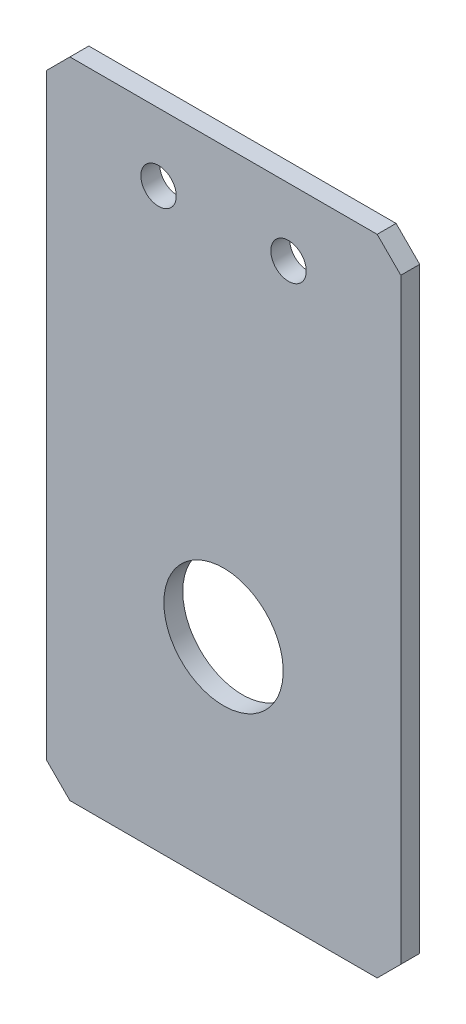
ISO-10303-21;
HEADER;
FILE_DESCRIPTION(('STEP AP214'),'2;1');
FILE_NAME('part.step','',(''),(''),'','','');
FILE_SCHEMA(('AUTOMOTIVE_DESIGN { 1 0 10303 214 1 1 1 1 }'));
ENDSEC;
DATA;
#1=APPLICATION_CONTEXT('core data for automotive mechanical design processes');
#2=APPLICATION_PROTOCOL_DEFINITION('international standard','automotive_design',2000,#1);
#3=PRODUCT_CONTEXT('',#1,'mechanical');
#4=PRODUCT('Part','Part','',(#3));
#5=PRODUCT_RELATED_PRODUCT_CATEGORY('part','',(#4));
#6=PRODUCT_DEFINITION_FORMATION('','',#4);
#7=PRODUCT_DEFINITION_CONTEXT('part definition',#1,'design');
#8=PRODUCT_DEFINITION('design','',#6,#7);
#9=PRODUCT_DEFINITION_SHAPE('','',#8);
#10=(LENGTH_UNIT() NAMED_UNIT(*) SI_UNIT(.MILLI.,.METRE.));
#11=(NAMED_UNIT(*) PLANE_ANGLE_UNIT() SI_UNIT($,.RADIAN.));
#12=(NAMED_UNIT(*) SI_UNIT($,.STERADIAN.) SOLID_ANGLE_UNIT());
#13=UNCERTAINTY_MEASURE_WITH_UNIT(LENGTH_MEASURE(1.E-05),#10,'distance_accuracy_value','');
#14=(GEOMETRIC_REPRESENTATION_CONTEXT(3) GLOBAL_UNCERTAINTY_ASSIGNED_CONTEXT((#13)) GLOBAL_UNIT_ASSIGNED_CONTEXT((#10,
#11,#12)) REPRESENTATION_CONTEXT('',''));
#15=CARTESIAN_POINT('',(0.,0.,0.));
#16=DIRECTION('',(0.,0.,1.));
#17=DIRECTION('',(1.,0.,0.));
#18=AXIS2_PLACEMENT_3D('',#15,#16,#17);
#19=CARTESIAN_POINT('',(15.,17.1267114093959,1.6));
#20=DIRECTION('',(0.,0.,-0.999999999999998));
#21=DIRECTION('',(-1.,0.,0.));
#22=AXIS2_PLACEMENT_3D('',#19,#20,#21);
#23=PLANE('',#22);
#24=CARTESIAN_POINT('',(5.50000000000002,65.926711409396,1.6));
#25=DIRECTION('',(0.,0.,0.999999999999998));
#26=DIRECTION('',(1.,0.,0.));
#27=AXIS2_PLACEMENT_3D('',#24,#25,#26);
#28=CIRCLE('',#27,1.5);
#29=CARTESIAN_POINT('',(4.00000000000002,65.926711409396,1.6));
#30=VERTEX_POINT('',#29);
#31=EDGE_CURVE('E219',#30,#30,#28,.T.);
#32=ORIENTED_EDGE('',*,*,#31,.F.);
#33=EDGE_LOOP('',(#32));
#34=FACE_BOUND('',#33,.T.);
#35=DIRECTION('',(0.,1.,0.));
#36=VECTOR('',#35,1.);
#37=CARTESIAN_POINT('',(15.,69.626711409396,1.6));
#38=LINE('',#37,#36);
#39=CARTESIAN_POINT('',(15.,19.1267114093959,1.6));
#40=VERTEX_POINT('',#39);
#41=CARTESIAN_POINT('',(15.,69.626711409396,1.6));
#42=VERTEX_POINT('',#41);
#43=EDGE_CURVE('E124',#40,#42,#38,.T.);
#44=ORIENTED_EDGE('',*,*,#43,.T.);
#45=DIRECTION('',(-0.707106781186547,0.707106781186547,0.));
#46=VECTOR('',#45,1.);
#47=CARTESIAN_POINT('',(13.,71.626711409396,1.6));
#48=LINE('',#47,#46);
#49=CARTESIAN_POINT('',(13.,71.626711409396,1.6));
#50=VERTEX_POINT('',#49);
#51=EDGE_CURVE('E101',#42,#50,#48,.T.);
#52=ORIENTED_EDGE('',*,*,#51,.T.);
#53=DIRECTION('',(-1.,0.,0.));
#54=VECTOR('',#53,1.);
#55=CARTESIAN_POINT('',(-13.,71.626711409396,1.6));
#56=LINE('',#55,#54);
#57=CARTESIAN_POINT('',(-13.,71.626711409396,1.6));
#58=VERTEX_POINT('',#57);
#59=EDGE_CURVE('E127',#50,#58,#56,.T.);
#60=ORIENTED_EDGE('',*,*,#59,.T.);
#61=DIRECTION('',(-0.707106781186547,-0.707106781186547,0.));
#62=VECTOR('',#61,1.);
#63=CARTESIAN_POINT('',(-13.,71.626711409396,1.6));
#64=LINE('',#63,#62);
#65=CARTESIAN_POINT('',(-15.,69.626711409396,1.6));
#66=VERTEX_POINT('',#65);
#67=EDGE_CURVE('E129',#58,#66,#64,.T.);
#68=ORIENTED_EDGE('',*,*,#67,.T.);
#69=DIRECTION('',(0.,-1.,0.));
#70=VECTOR('',#69,1.);
#71=CARTESIAN_POINT('',(-15.,69.626711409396,1.6));
#72=LINE('',#71,#70);
#73=CARTESIAN_POINT('',(-15.,19.1267114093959,1.6));
#74=VERTEX_POINT('',#73);
#75=EDGE_CURVE('E131',#66,#74,#72,.T.);
#76=ORIENTED_EDGE('',*,*,#75,.T.);
#77=DIRECTION('',(0.707106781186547,-0.707106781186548,0.));
#78=VECTOR('',#77,1.);
#79=CARTESIAN_POINT('',(-15.,19.1267114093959,1.6));
#80=LINE('',#79,#78);
#81=CARTESIAN_POINT('',(-13.,17.1267114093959,1.6));
#82=VERTEX_POINT('',#81);
#83=EDGE_CURVE('E133',#74,#82,#80,.T.);
#84=ORIENTED_EDGE('',*,*,#83,.T.);
#85=DIRECTION('',(1.,0.,0.));
#86=VECTOR('',#85,1.);
#87=CARTESIAN_POINT('',(13.,17.1267114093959,1.6));
#88=LINE('',#87,#86);
#89=CARTESIAN_POINT('',(13.,17.1267114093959,1.6));
#90=VERTEX_POINT('',#89);
#91=EDGE_CURVE('E42',#82,#90,#88,.T.);
#92=ORIENTED_EDGE('',*,*,#91,.T.);
#93=DIRECTION('',(0.707106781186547,0.707106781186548,0.));
#94=VECTOR('',#93,1.);
#95=CARTESIAN_POINT('',(15.,19.1267114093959,1.6));
#96=LINE('',#95,#94);
#97=EDGE_CURVE('E37',#90,#40,#96,.T.);
#98=ORIENTED_EDGE('',*,*,#97,.T.);
#99=EDGE_LOOP('',(#44,#52,#60,#68,#76,#84,#92,#98));
#100=FACE_BOUND('',#99,.T.);
#101=CARTESIAN_POINT('',(0.,35.626711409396,1.6));
#102=DIRECTION('',(0.,0.,0.999999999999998));
#103=DIRECTION('',(1.,0.,0.));
#104=AXIS2_PLACEMENT_3D('',#101,#102,#103);
#105=CIRCLE('',#104,5.05);
#106=CARTESIAN_POINT('',(-5.05,35.626711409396,1.6));
#107=VERTEX_POINT('',#106);
#108=EDGE_CURVE('E106',#107,#107,#105,.T.);
#109=ORIENTED_EDGE('',*,*,#108,.F.);
#110=EDGE_LOOP('',(#109));
#111=FACE_BOUND('',#110,.T.);
#112=CARTESIAN_POINT('',(-5.49999999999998,65.926711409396,1.59999999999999));
#113=DIRECTION('',(0.,0.,0.999999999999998));
#114=DIRECTION('',(-1.,0.,0.));
#115=AXIS2_PLACEMENT_3D('',#112,#113,#114);
#116=CIRCLE('',#115,1.5);
#117=CARTESIAN_POINT('',(-6.99999999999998,65.926711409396,1.59999999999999));
#118=VERTEX_POINT('',#117);
#119=EDGE_CURVE('E208',#118,#118,#116,.T.);
#120=ORIENTED_EDGE('',*,*,#119,.F.);
#121=EDGE_LOOP('',(#120));
#122=FACE_BOUND('',#121,.T.);
#123=ADVANCED_FACE('F22',(#34,#100,#111,#122),#23,.F.);
#124=CARTESIAN_POINT('',(15.,17.1267114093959,0.));
#125=DIRECTION('',(0.,0.,-0.999999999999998));
#126=DIRECTION('',(-1.,0.,0.));
#127=AXIS2_PLACEMENT_3D('',#124,#125,#126);
#128=PLANE('',#127);
#129=CARTESIAN_POINT('',(5.5,65.926711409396,0.));
#130=DIRECTION('',(0.,0.,0.999999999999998));
#131=DIRECTION('',(1.,0.,0.));
#132=AXIS2_PLACEMENT_3D('',#129,#130,#131);
#133=CIRCLE('',#132,1.5);
#134=CARTESIAN_POINT('',(4.00000000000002,65.926711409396,0.));
#135=VERTEX_POINT('',#134);
#136=EDGE_CURVE('E214',#135,#135,#133,.T.);
#137=ORIENTED_EDGE('',*,*,#136,.T.);
#138=EDGE_LOOP('',(#137));
#139=FACE_BOUND('',#138,.T.);
#140=DIRECTION('',(0.,1.,0.));
#141=VECTOR('',#140,1.);
#142=CARTESIAN_POINT('',(15.,69.626711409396,0.));
#143=LINE('',#142,#141);
#144=CARTESIAN_POINT('',(15.,19.1267114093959,0.));
#145=VERTEX_POINT('',#144);
#146=CARTESIAN_POINT('',(15.,69.626711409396,0.));
#147=VERTEX_POINT('',#146);
#148=EDGE_CURVE('E92',#145,#147,#143,.T.);
#149=ORIENTED_EDGE('',*,*,#148,.F.);
#150=DIRECTION('',(0.707106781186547,0.707106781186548,0.));
#151=VECTOR('',#150,1.);
#152=CARTESIAN_POINT('',(15.,19.1267114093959,0.));
#153=LINE('',#152,#151);
#154=CARTESIAN_POINT('',(13.,17.1267114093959,0.));
#155=VERTEX_POINT('',#154);
#156=EDGE_CURVE('E122',#155,#145,#153,.T.);
#157=ORIENTED_EDGE('',*,*,#156,.F.);
#158=DIRECTION('',(1.,0.,0.));
#159=VECTOR('',#158,1.);
#160=CARTESIAN_POINT('',(13.,17.1267114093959,0.));
#161=LINE('',#160,#159);
#162=CARTESIAN_POINT('',(-13.,17.1267114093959,0.));
#163=VERTEX_POINT('',#162);
#164=EDGE_CURVE('E120',#163,#155,#161,.T.);
#165=ORIENTED_EDGE('',*,*,#164,.F.);
#166=DIRECTION('',(0.707106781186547,-0.707106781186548,0.));
#167=VECTOR('',#166,1.);
#168=CARTESIAN_POINT('',(-15.,19.1267114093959,0.));
#169=LINE('',#168,#167);
#170=CARTESIAN_POINT('',(-15.,19.1267114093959,0.));
#171=VERTEX_POINT('',#170);
#172=EDGE_CURVE('E118',#171,#163,#169,.T.);
#173=ORIENTED_EDGE('',*,*,#172,.F.);
#174=DIRECTION('',(0.,-1.,0.));
#175=VECTOR('',#174,1.);
#176=CARTESIAN_POINT('',(-15.,69.626711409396,0.));
#177=LINE('',#176,#175);
#178=CARTESIAN_POINT('',(-15.,69.626711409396,0.));
#179=VERTEX_POINT('',#178);
#180=EDGE_CURVE('E116',#179,#171,#177,.T.);
#181=ORIENTED_EDGE('',*,*,#180,.F.);
#182=DIRECTION('',(-0.707106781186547,-0.707106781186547,0.));
#183=VECTOR('',#182,1.);
#184=CARTESIAN_POINT('',(-13.,71.626711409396,0.));
#185=LINE('',#184,#183);
#186=CARTESIAN_POINT('',(-13.,71.626711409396,0.));
#187=VERTEX_POINT('',#186);
#188=EDGE_CURVE('E114',#187,#179,#185,.T.);
#189=ORIENTED_EDGE('',*,*,#188,.F.);
#190=DIRECTION('',(-1.,0.,0.));
#191=VECTOR('',#190,1.);
#192=CARTESIAN_POINT('',(-13.,71.626711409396,0.));
#193=LINE('',#192,#191);
#194=CARTESIAN_POINT('',(13.,71.626711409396,0.));
#195=VERTEX_POINT('',#194);
#196=EDGE_CURVE('E94',#195,#187,#193,.T.);
#197=ORIENTED_EDGE('',*,*,#196,.F.);
#198=DIRECTION('',(-0.707106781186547,0.707106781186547,0.));
#199=VECTOR('',#198,1.);
#200=CARTESIAN_POINT('',(13.,71.626711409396,0.));
#201=LINE('',#200,#199);
#202=EDGE_CURVE('E87',#147,#195,#201,.T.);
#203=ORIENTED_EDGE('',*,*,#202,.F.);
#204=EDGE_LOOP('',(#149,#157,#165,#173,#181,#189,#197,#203));
#205=FACE_BOUND('',#204,.T.);
#206=CARTESIAN_POINT('',(0.,35.626711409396,0.));
#207=DIRECTION('',(0.,0.,0.999999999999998));
#208=DIRECTION('',(1.,0.,0.));
#209=AXIS2_PLACEMENT_3D('',#206,#207,#208);
#210=CIRCLE('',#209,5.05);
#211=CARTESIAN_POINT('',(-5.05,35.626711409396,0.));
#212=VERTEX_POINT('',#211);
#213=EDGE_CURVE('E109',#212,#212,#210,.T.);
#214=ORIENTED_EDGE('',*,*,#213,.T.);
#215=EDGE_LOOP('',(#214));
#216=FACE_BOUND('',#215,.T.);
#217=CARTESIAN_POINT('',(-5.50000000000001,65.926711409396,0.));
#218=DIRECTION('',(0.,0.,0.999999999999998));
#219=DIRECTION('',(-1.,0.,0.));
#220=AXIS2_PLACEMENT_3D('',#217,#218,#219);
#221=CIRCLE('',#220,1.5);
#222=CARTESIAN_POINT('',(-6.99999999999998,65.926711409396,0.));
#223=VERTEX_POINT('',#222);
#224=EDGE_CURVE('E211',#223,#223,#221,.T.);
#225=ORIENTED_EDGE('',*,*,#224,.T.);
#226=EDGE_LOOP('',(#225));
#227=FACE_BOUND('',#226,.T.);
#228=ADVANCED_FACE('F88',(#139,#205,#216,#227),#128,.T.);
#229=CARTESIAN_POINT('',(15.,69.626711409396,1.6));
#230=DIRECTION('',(-1.,0.,0.));
#231=DIRECTION('',(0.,-1.,0.));
#232=AXIS2_PLACEMENT_3D('',#229,#230,#231);
#233=PLANE('',#232);
#234=ORIENTED_EDGE('',*,*,#148,.T.);
#235=DIRECTION('',(0.,0.,-0.999999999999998));
#236=VECTOR('',#235,1.);
#237=CARTESIAN_POINT('',(15.,69.626711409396,1.6));
#238=LINE('',#237,#236);
#239=EDGE_CURVE('E11',#42,#147,#238,.T.);
#240=ORIENTED_EDGE('',*,*,#239,.F.);
#241=ORIENTED_EDGE('',*,*,#43,.F.);
#242=DIRECTION('',(0.,0.,-0.999999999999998));
#243=VECTOR('',#242,1.);
#244=CARTESIAN_POINT('',(15.,19.1267114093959,1.6));
#245=LINE('',#244,#243);
#246=EDGE_CURVE('E105',#40,#145,#245,.T.);
#247=ORIENTED_EDGE('',*,*,#246,.T.);
#248=EDGE_LOOP('',(#234,#240,#241,#247));
#249=FACE_BOUND('',#248,.T.);
#250=ADVANCED_FACE('F24',(#249),#233,.F.);
#251=CARTESIAN_POINT('',(13.,71.626711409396,1.6));
#252=DIRECTION('',(-0.707106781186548,-0.707106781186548,0.));
#253=DIRECTION('',(0.707106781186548,-0.707106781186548,0.));
#254=AXIS2_PLACEMENT_3D('',#251,#252,#253);
#255=PLANE('',#254);
#256=ORIENTED_EDGE('',*,*,#202,.T.);
#257=DIRECTION('',(0.,0.,-0.999999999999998));
#258=VECTOR('',#257,1.);
#259=CARTESIAN_POINT('',(13.,71.626711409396,1.6));
#260=LINE('',#259,#258);
#261=EDGE_CURVE('E30',#50,#195,#260,.T.);
#262=ORIENTED_EDGE('',*,*,#261,.F.);
#263=ORIENTED_EDGE('',*,*,#51,.F.);
#264=ORIENTED_EDGE('',*,*,#239,.T.);
#265=EDGE_LOOP('',(#256,#262,#263,#264));
#266=FACE_BOUND('',#265,.T.);
#267=ADVANCED_FACE('F100',(#266),#255,.F.);
#268=CARTESIAN_POINT('',(-13.,71.626711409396,1.6));
#269=DIRECTION('',(0.,-1.,0.));
#270=DIRECTION('',(0.,0.,-0.999999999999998));
#271=AXIS2_PLACEMENT_3D('',#268,#269,#270);
#272=PLANE('',#271);
#273=ORIENTED_EDGE('',*,*,#196,.T.);
#274=DIRECTION('',(0.,0.,-0.999999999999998));
#275=VECTOR('',#274,1.);
#276=CARTESIAN_POINT('',(-13.,71.626711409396,1.6));
#277=LINE('',#276,#275);
#278=EDGE_CURVE('E150',#58,#187,#277,.T.);
#279=ORIENTED_EDGE('',*,*,#278,.F.);
#280=ORIENTED_EDGE('',*,*,#59,.F.);
#281=ORIENTED_EDGE('',*,*,#261,.T.);
#282=EDGE_LOOP('',(#273,#279,#280,#281));
#283=FACE_BOUND('',#282,.T.);
#284=ADVANCED_FACE('F154',(#283),#272,.F.);
#285=CARTESIAN_POINT('',(-13.,71.626711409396,1.6));
#286=DIRECTION('',(0.707106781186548,-0.707106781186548,0.));
#287=DIRECTION('',(0.707106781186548,0.707106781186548,0.));
#288=AXIS2_PLACEMENT_3D('',#285,#286,#287);
#289=PLANE('',#288);
#290=ORIENTED_EDGE('',*,*,#188,.T.);
#291=DIRECTION('',(0.,0.,-0.999999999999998));
#292=VECTOR('',#291,1.);
#293=CARTESIAN_POINT('',(-15.,69.626711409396,1.6));
#294=LINE('',#293,#292);
#295=EDGE_CURVE('E147',#66,#179,#294,.T.);
#296=ORIENTED_EDGE('',*,*,#295,.F.);
#297=ORIENTED_EDGE('',*,*,#67,.F.);
#298=ORIENTED_EDGE('',*,*,#278,.T.);
#299=EDGE_LOOP('',(#290,#296,#297,#298));
#300=FACE_BOUND('',#299,.T.);
#301=ADVANCED_FACE('F162',(#300),#289,.F.);
#302=CARTESIAN_POINT('',(-15.,69.626711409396,1.6));
#303=DIRECTION('',(1.,0.,0.));
#304=DIRECTION('',(0.,1.,0.));
#305=AXIS2_PLACEMENT_3D('',#302,#303,#304);
#306=PLANE('',#305);
#307=ORIENTED_EDGE('',*,*,#180,.T.);
#308=DIRECTION('',(0.,0.,-0.999999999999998));
#309=VECTOR('',#308,1.);
#310=CARTESIAN_POINT('',(-15.,19.1267114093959,1.6));
#311=LINE('',#310,#309);
#312=EDGE_CURVE('E144',#74,#171,#311,.T.);
#313=ORIENTED_EDGE('',*,*,#312,.F.);
#314=ORIENTED_EDGE('',*,*,#75,.F.);
#315=ORIENTED_EDGE('',*,*,#295,.T.);
#316=EDGE_LOOP('',(#307,#313,#314,#315));
#317=FACE_BOUND('',#316,.T.);
#318=ADVANCED_FACE('F165',(#317),#306,.F.);
#319=CARTESIAN_POINT('',(-15.,19.1267114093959,1.6));
#320=DIRECTION('',(0.707106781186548,0.707106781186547,0.));
#321=DIRECTION('',(-0.707106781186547,0.707106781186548,0.));
#322=AXIS2_PLACEMENT_3D('',#319,#320,#321);
#323=PLANE('',#322);
#324=ORIENTED_EDGE('',*,*,#172,.T.);
#325=DIRECTION('',(0.,0.,-0.999999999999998));
#326=VECTOR('',#325,1.);
#327=CARTESIAN_POINT('',(-13.,17.1267114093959,1.6));
#328=LINE('',#327,#326);
#329=EDGE_CURVE('E141',#82,#163,#328,.T.);
#330=ORIENTED_EDGE('',*,*,#329,.F.);
#331=ORIENTED_EDGE('',*,*,#83,.F.);
#332=ORIENTED_EDGE('',*,*,#312,.T.);
#333=EDGE_LOOP('',(#324,#330,#331,#332));
#334=FACE_BOUND('',#333,.T.);
#335=ADVANCED_FACE('F170',(#334),#323,.F.);
#336=CARTESIAN_POINT('',(13.,17.1267114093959,1.6));
#337=DIRECTION('',(0.,1.,0.));
#338=DIRECTION('',(-1.,0.,0.));
#339=AXIS2_PLACEMENT_3D('',#336,#337,#338);
#340=PLANE('',#339);
#341=ORIENTED_EDGE('',*,*,#164,.T.);
#342=DIRECTION('',(0.,0.,-0.999999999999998));
#343=VECTOR('',#342,1.);
#344=CARTESIAN_POINT('',(13.,17.1267114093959,1.6));
#345=LINE('',#344,#343);
#346=EDGE_CURVE('E138',#90,#155,#345,.T.);
#347=ORIENTED_EDGE('',*,*,#346,.F.);
#348=ORIENTED_EDGE('',*,*,#91,.F.);
#349=ORIENTED_EDGE('',*,*,#329,.T.);
#350=EDGE_LOOP('',(#341,#347,#348,#349));
#351=FACE_BOUND('',#350,.T.);
#352=ADVANCED_FACE('F173',(#351),#340,.F.);
#353=CARTESIAN_POINT('',(15.,19.1267114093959,1.6));
#354=DIRECTION('',(-0.707106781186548,0.707106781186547,0.));
#355=DIRECTION('',(-0.707106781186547,-0.707106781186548,0.));
#356=AXIS2_PLACEMENT_3D('',#353,#354,#355);
#357=PLANE('',#356);
#358=ORIENTED_EDGE('',*,*,#156,.T.);
#359=ORIENTED_EDGE('',*,*,#246,.F.);
#360=ORIENTED_EDGE('',*,*,#97,.F.);
#361=ORIENTED_EDGE('',*,*,#346,.T.);
#362=EDGE_LOOP('',(#358,#359,#360,#361));
#363=FACE_BOUND('',#362,.T.);
#364=ADVANCED_FACE('F175',(#363),#357,.F.);
#365=CARTESIAN_POINT('',(0.,35.626711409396,1.6));
#366=DIRECTION('',(0.,0.,-0.999999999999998));
#367=DIRECTION('',(-1.,0.,0.));
#368=AXIS2_PLACEMENT_3D('',#365,#366,#367);
#369=CYLINDRICAL_SURFACE('',#368,5.05);
#370=CARTESIAN_POINT('',(-5.05,35.626711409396,1.6));
#371=CARTESIAN_POINT('',(-5.05,35.626711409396,1.58333333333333));
#372=CARTESIAN_POINT('',(-5.05,35.626711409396,1.56666666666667));
#373=CARTESIAN_POINT('',(-5.05,35.626711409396,1.53333333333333));
#374=CARTESIAN_POINT('',(-5.05,35.626711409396,1.51666666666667));
#375=CARTESIAN_POINT('',(-5.05,35.626711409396,1.48333333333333));
#376=CARTESIAN_POINT('',(-5.05,35.626711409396,1.46666666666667));
#377=CARTESIAN_POINT('',(-5.05,35.626711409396,1.43333333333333));
#378=CARTESIAN_POINT('',(-5.05,35.626711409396,1.41666666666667));
#379=CARTESIAN_POINT('',(-5.05,35.626711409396,1.38333333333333));
#380=CARTESIAN_POINT('',(-5.05,35.626711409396,1.36666666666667));
#381=CARTESIAN_POINT('',(-5.05,35.626711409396,1.33333333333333));
#382=CARTESIAN_POINT('',(-5.05,35.626711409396,1.31666666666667));
#383=CARTESIAN_POINT('',(-5.05,35.626711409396,1.28333333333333));
#384=CARTESIAN_POINT('',(-5.05,35.626711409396,1.26666666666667));
#385=CARTESIAN_POINT('',(-5.05,35.626711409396,1.23333333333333));
#386=CARTESIAN_POINT('',(-5.05,35.626711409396,1.21666666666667));
#387=CARTESIAN_POINT('',(-5.05,35.626711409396,1.18333333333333));
#388=CARTESIAN_POINT('',(-5.05,35.626711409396,1.16666666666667));
#389=CARTESIAN_POINT('',(-5.05,35.626711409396,1.13333333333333));
#390=CARTESIAN_POINT('',(-5.05,35.626711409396,1.11666666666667));
#391=CARTESIAN_POINT('',(-5.05,35.626711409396,1.08333333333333));
#392=CARTESIAN_POINT('',(-5.05,35.626711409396,1.06666666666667));
#393=CARTESIAN_POINT('',(-5.05,35.626711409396,1.03333333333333));
#394=CARTESIAN_POINT('',(-5.05,35.626711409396,1.01666666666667));
#395=CARTESIAN_POINT('',(-5.05,35.626711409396,0.983333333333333));
#396=CARTESIAN_POINT('',(-5.05,35.626711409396,0.966666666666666));
#397=CARTESIAN_POINT('',(-5.05,35.626711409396,0.933333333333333));
#398=CARTESIAN_POINT('',(-5.05,35.626711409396,0.916666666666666));
#399=CARTESIAN_POINT('',(-5.05,35.626711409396,0.883333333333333));
#400=CARTESIAN_POINT('',(-5.05,35.626711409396,0.866666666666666));
#401=CARTESIAN_POINT('',(-5.05,35.626711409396,0.833333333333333));
#402=CARTESIAN_POINT('',(-5.05,35.626711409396,0.816666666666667));
#403=CARTESIAN_POINT('',(-5.05,35.626711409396,0.783333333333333));
#404=CARTESIAN_POINT('',(-5.05,35.626711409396,0.766666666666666));
#405=CARTESIAN_POINT('',(-5.05,35.626711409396,0.733333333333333));
#406=CARTESIAN_POINT('',(-5.05,35.626711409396,0.716666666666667));
#407=CARTESIAN_POINT('',(-5.05,35.626711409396,0.683333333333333));
#408=CARTESIAN_POINT('',(-5.05,35.626711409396,0.666666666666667));
#409=CARTESIAN_POINT('',(-5.05,35.626711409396,0.633333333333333));
#410=CARTESIAN_POINT('',(-5.05,35.626711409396,0.616666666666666));
#411=CARTESIAN_POINT('',(-5.05,35.626711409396,0.583333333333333));
#412=CARTESIAN_POINT('',(-5.05,35.626711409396,0.566666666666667));
#413=CARTESIAN_POINT('',(-5.05,35.626711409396,0.533333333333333));
#414=CARTESIAN_POINT('',(-5.05,35.626711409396,0.516666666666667));
#415=CARTESIAN_POINT('',(-5.05,35.626711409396,0.483333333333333));
#416=CARTESIAN_POINT('',(-5.05,35.626711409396,0.466666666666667));
#417=CARTESIAN_POINT('',(-5.05,35.626711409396,0.433333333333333));
#418=CARTESIAN_POINT('',(-5.05,35.626711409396,0.416666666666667));
#419=CARTESIAN_POINT('',(-5.05,35.626711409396,0.383333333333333));
#420=CARTESIAN_POINT('',(-5.05,35.626711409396,0.366666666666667));
#421=CARTESIAN_POINT('',(-5.05,35.626711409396,0.333333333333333));
#422=CARTESIAN_POINT('',(-5.05,35.626711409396,0.316666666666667));
#423=CARTESIAN_POINT('',(-5.05,35.626711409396,0.283333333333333));
#424=CARTESIAN_POINT('',(-5.05,35.626711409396,0.266666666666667));
#425=CARTESIAN_POINT('',(-5.05,35.626711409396,0.233333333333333));
#426=CARTESIAN_POINT('',(-5.05,35.626711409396,0.216666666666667));
#427=CARTESIAN_POINT('',(-5.05,35.626711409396,0.183333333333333));
#428=CARTESIAN_POINT('',(-5.05,35.626711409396,0.166666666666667));
#429=CARTESIAN_POINT('',(-5.05,35.626711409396,0.133333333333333));
#430=CARTESIAN_POINT('',(-5.05,35.626711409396,0.116666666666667));
#431=CARTESIAN_POINT('',(-5.05,35.626711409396,0.0833333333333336));
#432=CARTESIAN_POINT('',(-5.05,35.626711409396,0.0666666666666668));
#433=CARTESIAN_POINT('',(-5.05,35.626711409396,0.0333333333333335));
#434=CARTESIAN_POINT('',(-5.05,35.626711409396,0.0166666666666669));
#435=CARTESIAN_POINT('',(-5.05,35.626711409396,0.));
#436=B_SPLINE_CURVE_WITH_KNOTS('',3,(#370,#371,#372,#373,#374,#375,#376,#377,#378,#379,#380,
#381,#382,#383,#384,#385,#386,#387,#388,#389,#390,#391,#392,#393,#394,#395,#396,#397,#398,#399,
#400,#401,#402,#403,#404,#405,#406,#407,#408,#409,#410,#411,#412,#413,#414,#415,#416,#417,#418,
#419,#420,#421,#422,#423,#424,#425,#426,#427,#428,#429,#430,#431,#432,#433,#434,#435),
.UNSPECIFIED.,.F.,.F.,(4,2,2,2,2,2,2,2,2,2,2,2,2,2,2,2,2,2,2,2,2,2,2,2,2,2,2,2,2,2,2,2,4),(0.,
0.0500000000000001,0.1,0.15,0.2,0.25,0.3,0.35,0.4,0.45,0.5,0.55,0.6,0.65,0.7,0.75,0.8,0.85,0.9,
0.95,1.,1.05,1.1,1.15,1.2,1.25,1.3,1.35,1.4,1.45,1.5,1.55,1.6),.UNSPECIFIED.);
#437=EDGE_CURVE('BSEAM177',#107,#212,#436,.T.);
#438=ORIENTED_EDGE('',*,*,#108,.T.);
#439=ORIENTED_EDGE('',*,*,#213,.F.);
#440=ORIENTED_EDGE('',*,*,#437,.T.);
#441=ORIENTED_EDGE('',*,*,#437,.F.);
#442=EDGE_LOOP('',(#438,#440,#439,#441));
#443=FACE_BOUND('',#442,.T.);
#444=ADVANCED_FACE('F177',(#443),#369,.F.);
#445=CARTESIAN_POINT('',(5.50000000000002,65.926711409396,1.6));
#446=DIRECTION('',(0.,0.,-0.999999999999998));
#447=DIRECTION('',(-1.,0.,0.));
#448=AXIS2_PLACEMENT_3D('',#445,#446,#447);
#449=CYLINDRICAL_SURFACE('',#448,1.5);
#450=CARTESIAN_POINT('',(4.00000000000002,65.926711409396,1.6));
#451=CARTESIAN_POINT('',(4.00000000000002,65.926711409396,1.58333333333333));
#452=CARTESIAN_POINT('',(4.00000000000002,65.926711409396,1.56666666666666));
#453=CARTESIAN_POINT('',(4.00000000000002,65.926711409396,1.53333333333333));
#454=CARTESIAN_POINT('',(4.00000000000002,65.926711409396,1.51666666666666));
#455=CARTESIAN_POINT('',(4.00000000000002,65.926711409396,1.48333333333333));
#456=CARTESIAN_POINT('',(4.00000000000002,65.926711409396,1.46666666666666));
#457=CARTESIAN_POINT('',(4.00000000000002,65.926711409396,1.43333333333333));
#458=CARTESIAN_POINT('',(4.00000000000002,65.926711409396,1.41666666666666));
#459=CARTESIAN_POINT('',(4.00000000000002,65.926711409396,1.38333333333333));
#460=CARTESIAN_POINT('',(4.00000000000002,65.926711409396,1.36666666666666));
#461=CARTESIAN_POINT('',(4.00000000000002,65.926711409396,1.33333333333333));
#462=CARTESIAN_POINT('',(4.00000000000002,65.926711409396,1.31666666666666));
#463=CARTESIAN_POINT('',(4.00000000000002,65.926711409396,1.28333333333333));
#464=CARTESIAN_POINT('',(4.00000000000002,65.926711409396,1.26666666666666));
#465=CARTESIAN_POINT('',(4.00000000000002,65.926711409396,1.23333333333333));
#466=CARTESIAN_POINT('',(4.00000000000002,65.926711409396,1.21666666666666));
#467=CARTESIAN_POINT('',(4.00000000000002,65.926711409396,1.18333333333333));
#468=CARTESIAN_POINT('',(4.00000000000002,65.926711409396,1.16666666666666));
#469=CARTESIAN_POINT('',(4.00000000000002,65.926711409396,1.13333333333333));
#470=CARTESIAN_POINT('',(4.00000000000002,65.926711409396,1.11666666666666));
#471=CARTESIAN_POINT('',(4.00000000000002,65.926711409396,1.08333333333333));
#472=CARTESIAN_POINT('',(4.00000000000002,65.926711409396,1.06666666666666));
#473=CARTESIAN_POINT('',(4.00000000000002,65.926711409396,1.03333333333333));
#474=CARTESIAN_POINT('',(4.00000000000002,65.926711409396,1.01666666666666));
#475=CARTESIAN_POINT('',(4.00000000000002,65.926711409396,0.983333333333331));
#476=CARTESIAN_POINT('',(4.00000000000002,65.926711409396,0.966666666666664));
#477=CARTESIAN_POINT('',(4.00000000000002,65.926711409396,0.933333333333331));
#478=CARTESIAN_POINT('',(4.00000000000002,65.926711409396,0.916666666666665));
#479=CARTESIAN_POINT('',(4.00000000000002,65.926711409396,0.883333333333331));
#480=CARTESIAN_POINT('',(4.00000000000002,65.926711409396,0.866666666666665));
#481=CARTESIAN_POINT('',(4.00000000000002,65.926711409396,0.833333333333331));
#482=CARTESIAN_POINT('',(4.00000000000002,65.926711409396,0.816666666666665));
#483=CARTESIAN_POINT('',(4.00000000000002,65.926711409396,0.783333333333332));
#484=CARTESIAN_POINT('',(4.00000000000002,65.926711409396,0.766666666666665));
#485=CARTESIAN_POINT('',(4.00000000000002,65.926711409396,0.733333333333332));
#486=CARTESIAN_POINT('',(4.00000000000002,65.926711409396,0.716666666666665));
#487=CARTESIAN_POINT('',(4.00000000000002,65.926711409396,0.683333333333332));
#488=CARTESIAN_POINT('',(4.00000000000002,65.926711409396,0.666666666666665));
#489=CARTESIAN_POINT('',(4.00000000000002,65.926711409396,0.633333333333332));
#490=CARTESIAN_POINT('',(4.00000000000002,65.926711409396,0.616666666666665));
#491=CARTESIAN_POINT('',(4.00000000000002,65.926711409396,0.583333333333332));
#492=CARTESIAN_POINT('',(4.00000000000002,65.926711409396,0.566666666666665));
#493=CARTESIAN_POINT('',(4.00000000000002,65.926711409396,0.533333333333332));
#494=CARTESIAN_POINT('',(4.00000000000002,65.926711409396,0.516666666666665));
#495=CARTESIAN_POINT('',(4.00000000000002,65.926711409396,0.483333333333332));
#496=CARTESIAN_POINT('',(4.00000000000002,65.926711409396,0.466666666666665));
#497=CARTESIAN_POINT('',(4.00000000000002,65.926711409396,0.433333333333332));
#498=CARTESIAN_POINT('',(4.00000000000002,65.926711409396,0.416666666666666));
#499=CARTESIAN_POINT('',(4.00000000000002,65.926711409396,0.383333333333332));
#500=CARTESIAN_POINT('',(4.00000000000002,65.926711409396,0.366666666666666));
#501=CARTESIAN_POINT('',(4.00000000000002,65.926711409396,0.333333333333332));
#502=CARTESIAN_POINT('',(4.00000000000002,65.926711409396,0.316666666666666));
#503=CARTESIAN_POINT('',(4.00000000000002,65.926711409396,0.283333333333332));
#504=CARTESIAN_POINT('',(4.00000000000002,65.926711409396,0.266666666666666));
#505=CARTESIAN_POINT('',(4.00000000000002,65.926711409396,0.233333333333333));
#506=CARTESIAN_POINT('',(4.00000000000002,65.926711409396,0.216666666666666));
#507=CARTESIAN_POINT('',(4.00000000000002,65.926711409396,0.183333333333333));
#508=CARTESIAN_POINT('',(4.00000000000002,65.926711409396,0.166666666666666));
#509=CARTESIAN_POINT('',(4.00000000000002,65.926711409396,0.133333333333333));
#510=CARTESIAN_POINT('',(4.00000000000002,65.926711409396,0.116666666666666));
#511=CARTESIAN_POINT('',(4.00000000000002,65.926711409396,0.0833333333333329));
#512=CARTESIAN_POINT('',(4.00000000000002,65.926711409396,0.0666666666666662));
#513=CARTESIAN_POINT('',(4.00000000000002,65.926711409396,0.0333333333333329));
#514=CARTESIAN_POINT('',(4.00000000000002,65.926711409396,0.0166666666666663));
#515=CARTESIAN_POINT('',(4.00000000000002,65.926711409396,0.));
#516=B_SPLINE_CURVE_WITH_KNOTS('',3,(#450,#451,#452,#453,#454,#455,#456,#457,#458,#459,#460,
#461,#462,#463,#464,#465,#466,#467,#468,#469,#470,#471,#472,#473,#474,#475,#476,#477,#478,#479,
#480,#481,#482,#483,#484,#485,#486,#487,#488,#489,#490,#491,#492,#493,#494,#495,#496,#497,#498,
#499,#500,#501,#502,#503,#504,#505,#506,#507,#508,#509,#510,#511,#512,#513,#514,#515),
.UNSPECIFIED.,.F.,.F.,(4,2,2,2,2,2,2,2,2,2,2,2,2,2,2,2,2,2,2,2,2,2,2,2,2,2,2,2,2,2,2,2,4),(0.,
0.0499999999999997,0.0999999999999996,0.15,0.199999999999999,0.249999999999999,
0.299999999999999,0.349999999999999,0.399999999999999,0.449999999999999,0.499999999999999,
0.549999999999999,0.599999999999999,0.649999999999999,0.699999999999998,0.749999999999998,
0.799999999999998,0.849999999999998,0.899999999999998,0.949999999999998,0.999999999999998,1.05,
1.1,1.15,1.2,1.25,1.3,1.35,1.4,1.45,1.5,1.55,1.6),.UNSPECIFIED.);
#517=EDGE_CURVE('BSEAM183',#30,#135,#516,.T.);
#518=ORIENTED_EDGE('',*,*,#31,.T.);
#519=ORIENTED_EDGE('',*,*,#136,.F.);
#520=ORIENTED_EDGE('',*,*,#517,.T.);
#521=ORIENTED_EDGE('',*,*,#517,.F.);
#522=EDGE_LOOP('',(#518,#520,#519,#521));
#523=FACE_BOUND('',#522,.T.);
#524=ADVANCED_FACE('F183',(#523),#449,.F.);
#525=CARTESIAN_POINT('',(-5.49999999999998,65.926711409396,1.59999999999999));
#526=DIRECTION('',(0.,0.,-0.999999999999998));
#527=DIRECTION('',(-1.,0.,0.));
#528=AXIS2_PLACEMENT_3D('',#525,#526,#527);
#529=CYLINDRICAL_SURFACE('',#528,1.5);
#530=CARTESIAN_POINT('',(-6.99999999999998,65.926711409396,1.59999999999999));
#531=CARTESIAN_POINT('',(-6.99999999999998,65.926711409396,1.58333333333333));
#532=CARTESIAN_POINT('',(-6.99999999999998,65.926711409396,1.56666666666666));
#533=CARTESIAN_POINT('',(-6.99999999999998,65.926711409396,1.53333333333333));
#534=CARTESIAN_POINT('',(-6.99999999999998,65.926711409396,1.51666666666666));
#535=CARTESIAN_POINT('',(-6.99999999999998,65.926711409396,1.48333333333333));
#536=CARTESIAN_POINT('',(-6.99999999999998,65.926711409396,1.46666666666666));
#537=CARTESIAN_POINT('',(-6.99999999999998,65.926711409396,1.43333333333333));
#538=CARTESIAN_POINT('',(-6.99999999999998,65.926711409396,1.41666666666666));
#539=CARTESIAN_POINT('',(-6.99999999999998,65.926711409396,1.38333333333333));
#540=CARTESIAN_POINT('',(-6.99999999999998,65.926711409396,1.36666666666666));
#541=CARTESIAN_POINT('',(-6.99999999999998,65.926711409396,1.33333333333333));
#542=CARTESIAN_POINT('',(-6.99999999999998,65.926711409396,1.31666666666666));
#543=CARTESIAN_POINT('',(-6.99999999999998,65.926711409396,1.28333333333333));
#544=CARTESIAN_POINT('',(-6.99999999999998,65.926711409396,1.26666666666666));
#545=CARTESIAN_POINT('',(-6.99999999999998,65.926711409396,1.23333333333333));
#546=CARTESIAN_POINT('',(-6.99999999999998,65.926711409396,1.21666666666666));
#547=CARTESIAN_POINT('',(-6.99999999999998,65.926711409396,1.18333333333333));
#548=CARTESIAN_POINT('',(-6.99999999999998,65.926711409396,1.16666666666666));
#549=CARTESIAN_POINT('',(-6.99999999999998,65.926711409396,1.13333333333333));
#550=CARTESIAN_POINT('',(-6.99999999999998,65.926711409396,1.11666666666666));
#551=CARTESIAN_POINT('',(-6.99999999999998,65.926711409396,1.08333333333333));
#552=CARTESIAN_POINT('',(-6.99999999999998,65.926711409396,1.06666666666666));
#553=CARTESIAN_POINT('',(-6.99999999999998,65.926711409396,1.03333333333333));
#554=CARTESIAN_POINT('',(-6.99999999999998,65.926711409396,1.01666666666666));
#555=CARTESIAN_POINT('',(-6.99999999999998,65.926711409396,0.983333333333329));
#556=CARTESIAN_POINT('',(-6.99999999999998,65.926711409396,0.966666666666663));
#557=CARTESIAN_POINT('',(-6.99999999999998,65.926711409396,0.93333333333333));
#558=CARTESIAN_POINT('',(-6.99999999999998,65.926711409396,0.916666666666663));
#559=CARTESIAN_POINT('',(-6.99999999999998,65.926711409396,0.88333333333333));
#560=CARTESIAN_POINT('',(-6.99999999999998,65.926711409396,0.866666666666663));
#561=CARTESIAN_POINT('',(-6.99999999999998,65.926711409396,0.83333333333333));
#562=CARTESIAN_POINT('',(-6.99999999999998,65.926711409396,0.816666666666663));
#563=CARTESIAN_POINT('',(-6.99999999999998,65.926711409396,0.78333333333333));
#564=CARTESIAN_POINT('',(-6.99999999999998,65.926711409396,0.766666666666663));
#565=CARTESIAN_POINT('',(-6.99999999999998,65.926711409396,0.73333333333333));
#566=CARTESIAN_POINT('',(-6.99999999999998,65.926711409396,0.716666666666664));
#567=CARTESIAN_POINT('',(-6.99999999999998,65.926711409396,0.68333333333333));
#568=CARTESIAN_POINT('',(-6.99999999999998,65.926711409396,0.666666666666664));
#569=CARTESIAN_POINT('',(-6.99999999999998,65.926711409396,0.633333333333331));
#570=CARTESIAN_POINT('',(-6.99999999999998,65.926711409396,0.616666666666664));
#571=CARTESIAN_POINT('',(-6.99999999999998,65.926711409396,0.583333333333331));
#572=CARTESIAN_POINT('',(-6.99999999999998,65.926711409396,0.566666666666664));
#573=CARTESIAN_POINT('',(-6.99999999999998,65.926711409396,0.533333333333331));
#574=CARTESIAN_POINT('',(-6.99999999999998,65.926711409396,0.516666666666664));
#575=CARTESIAN_POINT('',(-6.99999999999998,65.926711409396,0.483333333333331));
#576=CARTESIAN_POINT('',(-6.99999999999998,65.926711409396,0.466666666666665));
#577=CARTESIAN_POINT('',(-6.99999999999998,65.926711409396,0.433333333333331));
#578=CARTESIAN_POINT('',(-6.99999999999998,65.926711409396,0.416666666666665));
#579=CARTESIAN_POINT('',(-6.99999999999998,65.926711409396,0.383333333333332));
#580=CARTESIAN_POINT('',(-6.99999999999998,65.926711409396,0.366666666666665));
#581=CARTESIAN_POINT('',(-6.99999999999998,65.926711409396,0.333333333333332));
#582=CARTESIAN_POINT('',(-6.99999999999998,65.926711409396,0.316666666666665));
#583=CARTESIAN_POINT('',(-6.99999999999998,65.926711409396,0.283333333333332));
#584=CARTESIAN_POINT('',(-6.99999999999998,65.926711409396,0.266666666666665));
#585=CARTESIAN_POINT('',(-6.99999999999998,65.926711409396,0.233333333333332));
#586=CARTESIAN_POINT('',(-6.99999999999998,65.926711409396,0.216666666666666));
#587=CARTESIAN_POINT('',(-6.99999999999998,65.926711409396,0.183333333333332));
#588=CARTESIAN_POINT('',(-6.99999999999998,65.926711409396,0.166666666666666));
#589=CARTESIAN_POINT('',(-6.99999999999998,65.926711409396,0.133333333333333));
#590=CARTESIAN_POINT('',(-6.99999999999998,65.926711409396,0.116666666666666));
#591=CARTESIAN_POINT('',(-6.99999999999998,65.926711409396,0.0833333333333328));
#592=CARTESIAN_POINT('',(-6.99999999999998,65.926711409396,0.0666666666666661));
#593=CARTESIAN_POINT('',(-6.99999999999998,65.926711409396,0.0333333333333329));
#594=CARTESIAN_POINT('',(-6.99999999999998,65.926711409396,0.0166666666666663));
#595=CARTESIAN_POINT('',(-6.99999999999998,65.926711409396,0.));
#596=B_SPLINE_CURVE_WITH_KNOTS('',3,(#530,#531,#532,#533,#534,#535,#536,#537,#538,#539,#540,
#541,#542,#543,#544,#545,#546,#547,#548,#549,#550,#551,#552,#553,#554,#555,#556,#557,#558,#559,
#560,#561,#562,#563,#564,#565,#566,#567,#568,#569,#570,#571,#572,#573,#574,#575,#576,#577,#578,
#579,#580,#581,#582,#583,#584,#585,#586,#587,#588,#589,#590,#591,#592,#593,#594,#595),
.UNSPECIFIED.,.F.,.F.,(4,2,2,2,2,2,2,2,2,2,2,2,2,2,2,2,2,2,2,2,2,2,2,2,2,2,2,2,2,2,2,2,4),(0.,
0.0499999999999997,0.0999999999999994,0.149999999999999,0.199999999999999,0.249999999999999,
0.299999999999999,0.349999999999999,0.399999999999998,0.449999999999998,0.499999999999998,
0.549999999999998,0.599999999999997,0.649999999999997,0.699999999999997,0.749999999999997,
0.799999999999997,0.849999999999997,0.899999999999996,0.949999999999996,0.999999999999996,1.05,
1.1,1.15,1.2,1.24999999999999,1.29999999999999,1.34999999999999,1.39999999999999,
1.44999999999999,1.49999999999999,1.54999999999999,1.59999999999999),.UNSPECIFIED.);
#597=EDGE_CURVE('BSEAM199',#118,#223,#596,.T.);
#598=ORIENTED_EDGE('',*,*,#119,.T.);
#599=ORIENTED_EDGE('',*,*,#224,.F.);
#600=ORIENTED_EDGE('',*,*,#597,.T.);
#601=ORIENTED_EDGE('',*,*,#597,.F.);
#602=EDGE_LOOP('',(#598,#600,#599,#601));
#603=FACE_BOUND('',#602,.T.);
#604=ADVANCED_FACE('F199',(#603),#529,.F.);
#605=CLOSED_SHELL('',(#123,#228,#250,#267,#284,#301,#318,#335,#352,#364,#444,#524,#604));
#606=MANIFOLD_SOLID_BREP('B2',#605);
#607=ADVANCED_BREP_SHAPE_REPRESENTATION('',(#18,#606),#14);
#608=SHAPE_DEFINITION_REPRESENTATION(#9,#607);
ENDSEC;
END-ISO-10303-21;
